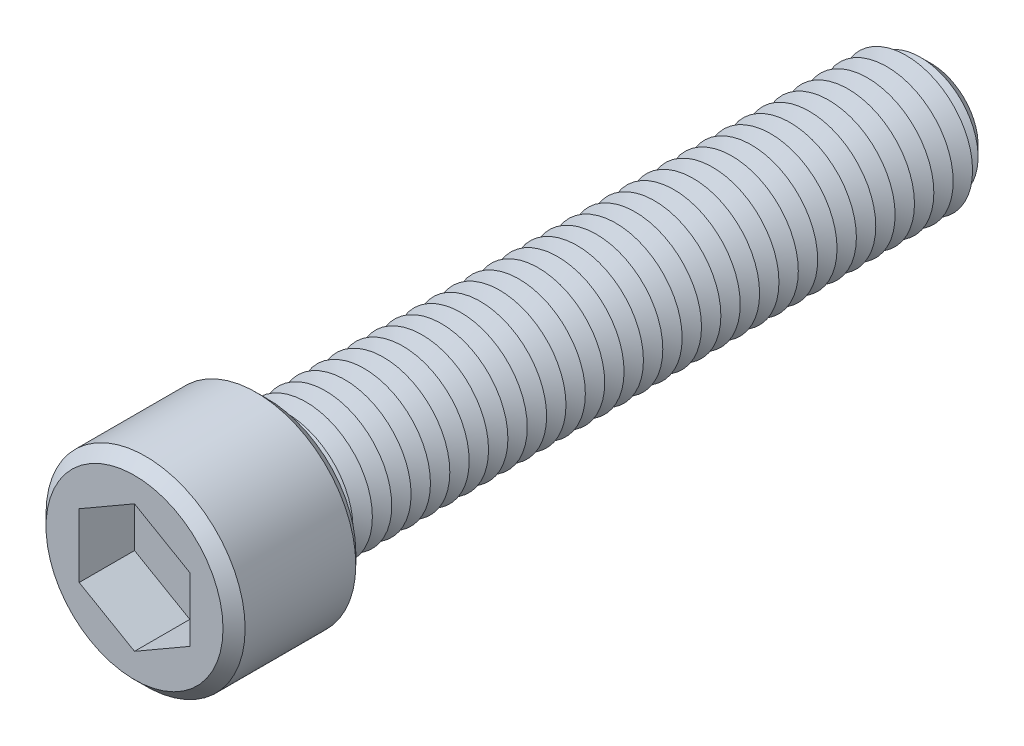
from build123d import *

# Parameters (mm, degrees)
SKETCH1_R           = 9
BOSS_EXTRUDE1_DEPTH = 12
SKETCH2_R           = 6
BOSS_EXTRUDE2_DEPTH = 60
CHAMFER1_SIZE       = 1.75
LPATTERN1_COUNT     = 34
LPATTERN1_PITCH     = 1.75
CUT_EXTRUDE1_DEPTH  = 5
SKETCH6_R           = 0.9
CUT_EXTRUDE2_DEPTH  = 67
CHAMFER2_SIZE       = 1


with BuildPart() as part:
    # Sketch1 → Boss-Extrude1 (new body)
    with BuildSketch(Plane.XY):
        Circle(SKETCH1_R)
    extrude(amount=BOSS_EXTRUDE1_DEPTH)

    # Sketch2 → Boss-Extrude2 (add)
    with BuildSketch(Plane(origin=(0, 0, 0), x_dir=(-1, 0, 0), z_dir=(0, 0, -1))):
        Circle(SKETCH2_R)
    extrude(amount=BOSS_EXTRUDE2_DEPTH)

    # Chamfer1
    chamfer1_edges = [part.edges().sort_by_distance(p)[0] for p in [
        (6, 0, -60),
    ]]
    chamfer(chamfer1_edges, length=CHAMFER1_SIZE)

    # Sketch4 → Cut-Revolve1 (revolve, cut)
    with BuildSketch(Plane(origin=(0, 0, 0), x_dir=(0, 0, -1), z_dir=(1, 0, 0)), mode=Mode.PRIVATE) as cut_revolve1_sk:
        Polygon((0, 6), (0.875, 4.484455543), (1.75, 6), align=None)
    cut_revolve1 = revolve(cut_revolve1_sk.sketch.rotate(Axis((0, 0, 2.512122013), (0, 0, -1)), 90), axis=Axis((0, 0, 2.512122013), (0, 0, -1)), mode=Mode.SUBTRACT)

    # LPattern1: Cut-Revolve1 ×34
    with Locations(*[(0, 0, -i * LPATTERN1_PITCH) for i in range(1, LPATTERN1_COUNT)]):
        add(cut_revolve1, mode=Mode.SUBTRACT)

    # Sketch5 → Cut-Extrude1 (cut)
    with BuildSketch(Plane.XY.offset(12)):
        Polygon((0, 5.773502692), (-5, 2.886751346), (-5, -2.886751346), (0, -5.773502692), (5, -2.886751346), (5, 2.886751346), align=None)
    extrude(amount=-CUT_EXTRUDE1_DEPTH, mode=Mode.SUBTRACT)

    # Sketch6 → Cut-Extrude2 (cut)
    with BuildSketch(Plane.XY.offset(7)):
        Circle(SKETCH6_R)
    extrude(amount=-CUT_EXTRUDE2_DEPTH, mode=Mode.SUBTRACT)

    # Chamfer2
    chamfer2_edges = [part.edges().sort_by_distance(p)[0] for p in [
        (-9, 0, 0),
        (-9, 0, 12),
    ]]
    chamfer(chamfer2_edges, length=CHAMFER2_SIZE)


solid = part.part
